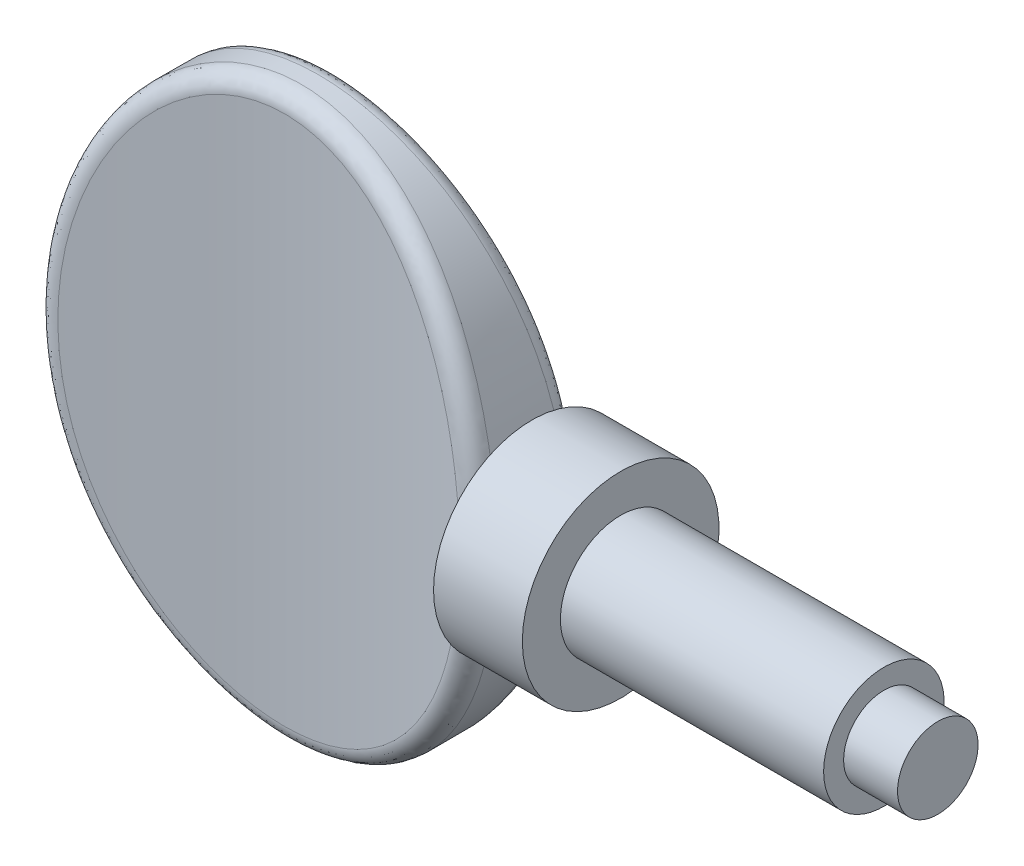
from build123d import *

# Parameters (mm, degrees)
SKETCH1_RX              = 11.303
SKETCH1_RY              = 8.889999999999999
EXTRUDE1_DEPTH          = 2.286
CUT_EXTRUDE1_DEPTH      = 15.560759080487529
CUT_EXTRUDE1_DEPTH_BACK = 15.560759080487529
SKETCH2_OUTSIDE_W       = 25.603999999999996
SKETCH2_OUTSIDE_H       = 12.396
FILLET3_R               = 0.6773333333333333


with BuildPart() as part:
    # Sketch1 → Extrude1 (new, symmetric)
    with BuildSketch(Plane.XY):
        with Locations(Location((0, 0), (0, 0, 90))):
            Ellipse(SKETCH1_RX, SKETCH1_RY)
    extrude(amount=EXTRUDE1_DEPTH, both=True)

    # Sketch2 outside → Cut-Extrude1 (cut, two sides: drawn at the far end of the back side and taken through both)
    with BuildSketch(Plane(origin=(0, 0, 0), x_dir=(1, 0, 0), z_dir=(0, 1, 0)).offset(-CUT_EXTRUDE1_DEPTH_BACK)):
        Rectangle(SKETCH2_OUTSIDE_W, SKETCH2_OUTSIDE_H)
        with BuildLine():
            Line((-8.889999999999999, 2.286), (-8.889999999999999, -2.286))
            ThreePointArc((-8.889999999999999, -2.286), (1.94e-15, -1.0159999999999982), (8.889999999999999, -2.286))
            Line((8.889999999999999, -2.286), (8.889999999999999, 2.286))
            ThreePointArc((8.889999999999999, 2.286), (1.94e-15, 1.0159999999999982), (-8.889999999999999, 2.286))
        make_face(mode=Mode.SUBTRACT)
    extrude(amount=CUT_EXTRUDE1_DEPTH + CUT_EXTRUDE1_DEPTH_BACK, mode=Mode.SUBTRACT)

    # Fillet3
    fillet3_edges = [part.edges().sort_by_distance(p)[0] for p in [
        (-6.499256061e-08, -11.302999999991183, 1.0159999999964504),
        (8.835220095e-08, -11.302999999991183, -1.0159999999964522),
    ]]
    fillet(fillet3_edges, radius=FILLET3_R)

    # Sketch3 → Revolve1 (revolve)
    with BuildSketch(Plane(origin=(0, 0, 0), x_dir=(1, 0, 0), z_dir=(0, 1, 0)), mode=Mode.PRIVATE) as revolve1_sk:
        with BuildLine():
            Line((12.445999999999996, 3.9369999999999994), (12.445999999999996, 2.413))
            Line((12.445999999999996, 2.413), (22.986999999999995, 2.4129999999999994))
            Line((22.986999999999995, 2.4129999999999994), (22.986999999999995, 1.6128999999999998))
            Line((22.986999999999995, 1.6128999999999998), (25.145999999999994, 1.6129))
            Line((25.145999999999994, 1.6129), (25.145999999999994, 0))
            Line((25.145999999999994, 0), (7.236423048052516, 0))
            Line((7.236423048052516, 0), (7.236423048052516, 1.8516557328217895))
            ThreePointArc((7.236423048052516, 1.8516557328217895), (8.426438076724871, 2.6063068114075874), (8.889999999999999, 3.9370000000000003))
            Line((8.889999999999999, 3.9370000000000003), (12.445999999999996, 3.9369999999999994))
        make_face()
    revolve(revolve1_sk.sketch.rotate(Axis((0, 0, 0), (1, 0, 0)), 180), axis=Axis((0, 0, 0), (1, 0, 0)))


solid = part.part
